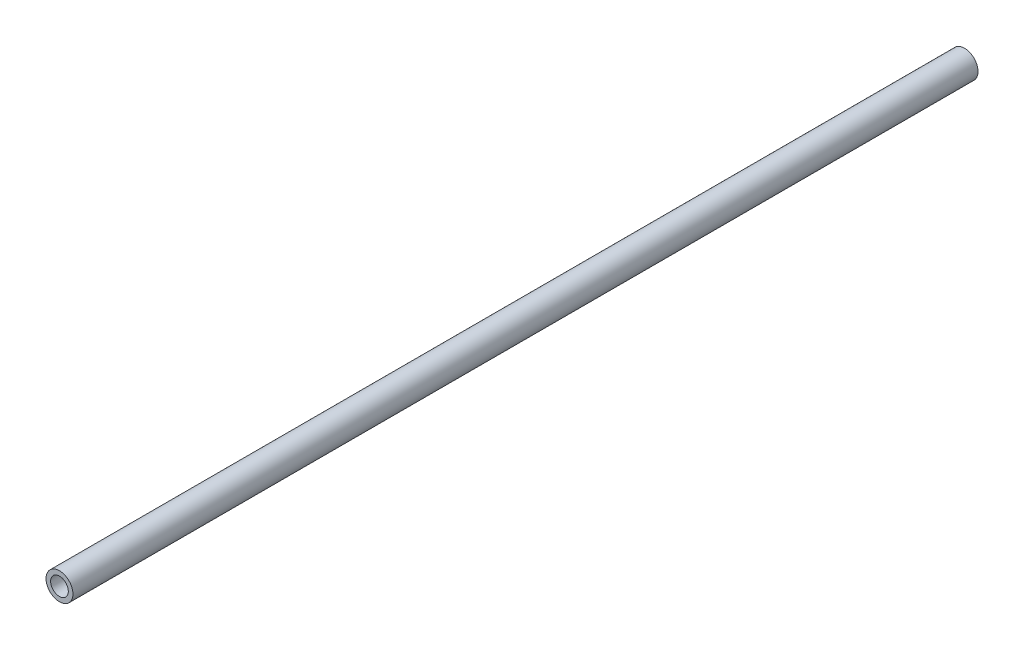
ISO-10303-21;
HEADER;
FILE_DESCRIPTION(('STEP AP214'),'2;1');
FILE_NAME('part.step','',(''),(''),'','','');
FILE_SCHEMA(('AUTOMOTIVE_DESIGN { 1 0 10303 214 1 1 1 1 }'));
ENDSEC;
DATA;
#1=APPLICATION_CONTEXT('core data for automotive mechanical design processes');
#2=APPLICATION_PROTOCOL_DEFINITION('international standard','automotive_design',2000,#1);
#3=PRODUCT_CONTEXT('',#1,'mechanical');
#4=PRODUCT('Part','Part','',(#3));
#5=PRODUCT_RELATED_PRODUCT_CATEGORY('part','',(#4));
#6=PRODUCT_DEFINITION_FORMATION('','',#4);
#7=PRODUCT_DEFINITION_CONTEXT('part definition',#1,'design');
#8=PRODUCT_DEFINITION('design','',#6,#7);
#9=PRODUCT_DEFINITION_SHAPE('','',#8);
#10=(LENGTH_UNIT() NAMED_UNIT(*) SI_UNIT(.MILLI.,.METRE.));
#11=(NAMED_UNIT(*) PLANE_ANGLE_UNIT() SI_UNIT($,.RADIAN.));
#12=(NAMED_UNIT(*) SI_UNIT($,.STERADIAN.) SOLID_ANGLE_UNIT());
#13=UNCERTAINTY_MEASURE_WITH_UNIT(LENGTH_MEASURE(1.E-05),#10,'distance_accuracy_value','');
#14=(GEOMETRIC_REPRESENTATION_CONTEXT(3) GLOBAL_UNCERTAINTY_ASSIGNED_CONTEXT((#13)) GLOBAL_UNIT_ASSIGNED_CONTEXT((#10,
#11,#12)) REPRESENTATION_CONTEXT('',''));
#15=CARTESIAN_POINT('',(0.,0.,0.));
#16=DIRECTION('',(0.,0.,1.));
#17=DIRECTION('',(1.,0.,0.));
#18=AXIS2_PLACEMENT_3D('',#15,#16,#17);
#19=CARTESIAN_POINT('',(0.,0.,205.));
#20=DIRECTION('',(0.,0.,1.));
#21=DIRECTION('',(1.,0.,0.));
#22=AXIS2_PLACEMENT_3D('',#19,#20,#21);
#23=PLANE('',#22);
#24=CARTESIAN_POINT('',(0.,0.,205.));
#25=DIRECTION('',(0.,0.,1.));
#26=DIRECTION('',(1.,0.,0.));
#27=AXIS2_PLACEMENT_3D('',#24,#25,#26);
#28=CIRCLE('',#27,3.05);
#29=CARTESIAN_POINT('',(-3.05,0.,205.));
#30=VERTEX_POINT('',#29);
#31=EDGE_CURVE('E10',#30,#30,#28,.T.);
#32=ORIENTED_EDGE('',*,*,#31,.T.);
#33=EDGE_LOOP('',(#32));
#34=FACE_BOUND('',#33,.T.);
#35=CARTESIAN_POINT('',(0.,0.,205.));
#36=DIRECTION('',(0.,0.,1.));
#37=DIRECTION('',(1.,0.,0.));
#38=AXIS2_PLACEMENT_3D('',#35,#36,#37);
#39=CIRCLE('',#38,2.);
#40=CARTESIAN_POINT('',(-2.,0.,205.));
#41=VERTEX_POINT('',#40);
#42=EDGE_CURVE('E56',#41,#41,#39,.T.);
#43=ORIENTED_EDGE('',*,*,#42,.F.);
#44=EDGE_LOOP('',(#43));
#45=FACE_BOUND('',#44,.T.);
#46=ADVANCED_FACE('F43',(#34,#45),#23,.T.);
#47=CARTESIAN_POINT('',(0.,0.,0.));
#48=DIRECTION('',(0.,0.,1.));
#49=DIRECTION('',(1.,0.,0.));
#50=AXIS2_PLACEMENT_3D('',#47,#48,#49);
#51=PLANE('',#50);
#52=CARTESIAN_POINT('',(0.,0.,0.));
#53=DIRECTION('',(0.,0.,1.));
#54=DIRECTION('',(1.,0.,0.));
#55=AXIS2_PLACEMENT_3D('',#52,#53,#54);
#56=CIRCLE('',#55,3.05);
#57=CARTESIAN_POINT('',(-3.05,0.,0.));
#58=VERTEX_POINT('',#57);
#59=EDGE_CURVE('E47',#58,#58,#56,.T.);
#60=ORIENTED_EDGE('',*,*,#59,.F.);
#61=EDGE_LOOP('',(#60));
#62=FACE_BOUND('',#61,.T.);
#63=CARTESIAN_POINT('',(0.,0.,0.));
#64=DIRECTION('',(0.,0.,1.));
#65=DIRECTION('',(1.,0.,0.));
#66=AXIS2_PLACEMENT_3D('',#63,#64,#65);
#67=CIRCLE('',#66,2.);
#68=CARTESIAN_POINT('',(-2.,0.,0.));
#69=VERTEX_POINT('',#68);
#70=EDGE_CURVE('E58',#69,#69,#67,.T.);
#71=ORIENTED_EDGE('',*,*,#70,.T.);
#72=EDGE_LOOP('',(#71));
#73=FACE_BOUND('',#72,.T.);
#74=ADVANCED_FACE('F70',(#62,#73),#51,.F.);
#75=CARTESIAN_POINT('',(0.,0.,205.));
#76=DIRECTION('',(0.,0.,-1.));
#77=DIRECTION('',(-1.,0.,0.));
#78=AXIS2_PLACEMENT_3D('',#75,#76,#77);
#79=CYLINDRICAL_SURFACE('',#78,3.05);
#80=CARTESIAN_POINT('',(-3.05,0.,205.));
#81=CARTESIAN_POINT('',(-3.05,0.,202.864583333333));
#82=CARTESIAN_POINT('',(-3.05,0.,200.729166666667));
#83=CARTESIAN_POINT('',(-3.05,0.,196.458333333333));
#84=CARTESIAN_POINT('',(-3.05,0.,194.322916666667));
#85=CARTESIAN_POINT('',(-3.05,0.,190.052083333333));
#86=CARTESIAN_POINT('',(-3.05,0.,187.916666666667));
#87=CARTESIAN_POINT('',(-3.05,0.,183.645833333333));
#88=CARTESIAN_POINT('',(-3.05,0.,181.510416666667));
#89=CARTESIAN_POINT('',(-3.05,0.,177.239583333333));
#90=CARTESIAN_POINT('',(-3.05,0.,175.104166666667));
#91=CARTESIAN_POINT('',(-3.05,0.,170.833333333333));
#92=CARTESIAN_POINT('',(-3.05,0.,168.697916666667));
#93=CARTESIAN_POINT('',(-3.05,0.,164.427083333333));
#94=CARTESIAN_POINT('',(-3.05,0.,162.291666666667));
#95=CARTESIAN_POINT('',(-3.05,0.,158.020833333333));
#96=CARTESIAN_POINT('',(-3.05,0.,155.885416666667));
#97=CARTESIAN_POINT('',(-3.05,0.,151.614583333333));
#98=CARTESIAN_POINT('',(-3.05,0.,149.479166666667));
#99=CARTESIAN_POINT('',(-3.05,0.,145.208333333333));
#100=CARTESIAN_POINT('',(-3.05,0.,143.072916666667));
#101=CARTESIAN_POINT('',(-3.05,0.,138.802083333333));
#102=CARTESIAN_POINT('',(-3.05,0.,136.666666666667));
#103=CARTESIAN_POINT('',(-3.05,0.,132.395833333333));
#104=CARTESIAN_POINT('',(-3.05,0.,130.260416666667));
#105=CARTESIAN_POINT('',(-3.05,0.,125.989583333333));
#106=CARTESIAN_POINT('',(-3.05,0.,123.854166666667));
#107=CARTESIAN_POINT('',(-3.05,0.,119.583333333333));
#108=CARTESIAN_POINT('',(-3.05,0.,117.447916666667));
#109=CARTESIAN_POINT('',(-3.05,0.,113.177083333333));
#110=CARTESIAN_POINT('',(-3.05,0.,111.041666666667));
#111=CARTESIAN_POINT('',(-3.05,0.,106.770833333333));
#112=CARTESIAN_POINT('',(-3.05,0.,104.635416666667));
#113=CARTESIAN_POINT('',(-3.05,0.,100.364583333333));
#114=CARTESIAN_POINT('',(-3.05,0.,98.2291666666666));
#115=CARTESIAN_POINT('',(-3.05,0.,93.9583333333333));
#116=CARTESIAN_POINT('',(-3.05,0.,91.8229166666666));
#117=CARTESIAN_POINT('',(-3.05,0.,87.5520833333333));
#118=CARTESIAN_POINT('',(-3.05,0.,85.4166666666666));
#119=CARTESIAN_POINT('',(-3.05,0.,81.1458333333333));
#120=CARTESIAN_POINT('',(-3.05,0.,79.0104166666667));
#121=CARTESIAN_POINT('',(-3.05,0.,74.7395833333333));
#122=CARTESIAN_POINT('',(-3.05,0.,72.6041666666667));
#123=CARTESIAN_POINT('',(-3.05,0.,68.3333333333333));
#124=CARTESIAN_POINT('',(-3.05,0.,66.1979166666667));
#125=CARTESIAN_POINT('',(-3.05,0.,61.9270833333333));
#126=CARTESIAN_POINT('',(-3.05,0.,59.7916666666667));
#127=CARTESIAN_POINT('',(-3.05,0.,55.5208333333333));
#128=CARTESIAN_POINT('',(-3.05,0.,53.3854166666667));
#129=CARTESIAN_POINT('',(-3.05,0.,49.1145833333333));
#130=CARTESIAN_POINT('',(-3.05,0.,46.9791666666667));
#131=CARTESIAN_POINT('',(-3.05,0.,42.7083333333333));
#132=CARTESIAN_POINT('',(-3.05,0.,40.5729166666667));
#133=CARTESIAN_POINT('',(-3.05,0.,36.3020833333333));
#134=CARTESIAN_POINT('',(-3.05,0.,34.1666666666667));
#135=CARTESIAN_POINT('',(-3.05,0.,29.8958333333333));
#136=CARTESIAN_POINT('',(-3.05,0.,27.7604166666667));
#137=CARTESIAN_POINT('',(-3.05,0.,23.4895833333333));
#138=CARTESIAN_POINT('',(-3.05,0.,21.3541666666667));
#139=CARTESIAN_POINT('',(-3.05,0.,17.0833333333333));
#140=CARTESIAN_POINT('',(-3.05,0.,14.9479166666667));
#141=CARTESIAN_POINT('',(-3.05,0.,10.6770833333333));
#142=CARTESIAN_POINT('',(-3.05,0.,8.54166666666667));
#143=CARTESIAN_POINT('',(-3.05,0.,4.27083333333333));
#144=CARTESIAN_POINT('',(-3.05,0.,2.13541666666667));
#145=CARTESIAN_POINT('',(-3.05,0.,0.));
#146=B_SPLINE_CURVE_WITH_KNOTS('',3,(#80,#81,#82,#83,#84,#85,#86,#87,#88,#89,#90,#91,#92,#93,
#94,#95,#96,#97,#98,#99,#100,#101,#102,#103,#104,#105,#106,#107,#108,#109,#110,#111,#112,#113,
#114,#115,#116,#117,#118,#119,#120,#121,#122,#123,#124,#125,#126,#127,#128,#129,#130,#131,#132,
#133,#134,#135,#136,#137,#138,#139,#140,#141,#142,#143,#144,#145),.UNSPECIFIED.,.F.,.F.,(4,2,2,
2,2,2,2,2,2,2,2,2,2,2,2,2,2,2,2,2,2,2,2,2,2,2,2,2,2,2,2,2,4),(0.,6.40625,12.8125,19.21875,
25.625,32.03125,38.4375,44.84375,51.25,57.65625,64.0625,70.46875,76.875,83.28125,89.6875,
96.09375,102.5,108.90625,115.3125,121.71875,128.125,134.53125,140.9375,147.34375,153.75,
160.15625,166.5625,172.96875,179.375,185.78125,192.1875,198.59375,205.),.UNSPECIFIED.);
#147=EDGE_CURVE('BSEAM45',#30,#58,#146,.T.);
#148=ORIENTED_EDGE('',*,*,#31,.F.);
#149=ORIENTED_EDGE('',*,*,#59,.T.);
#150=ORIENTED_EDGE('',*,*,#147,.T.);
#151=ORIENTED_EDGE('',*,*,#147,.F.);
#152=EDGE_LOOP('',(#148,#150,#149,#151));
#153=FACE_BOUND('',#152,.T.);
#154=ADVANCED_FACE('F45',(#153),#79,.T.);
#155=CARTESIAN_POINT('',(0.,0.,205.));
#156=DIRECTION('',(0.,0.,-1.));
#157=DIRECTION('',(-1.,0.,0.));
#158=AXIS2_PLACEMENT_3D('',#155,#156,#157);
#159=CYLINDRICAL_SURFACE('',#158,2.);
#160=CARTESIAN_POINT('',(-2.,0.,205.));
#161=CARTESIAN_POINT('',(-2.,0.,202.864583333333));
#162=CARTESIAN_POINT('',(-2.,0.,200.729166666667));
#163=CARTESIAN_POINT('',(-2.,0.,196.458333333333));
#164=CARTESIAN_POINT('',(-2.,0.,194.322916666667));
#165=CARTESIAN_POINT('',(-2.,0.,190.052083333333));
#166=CARTESIAN_POINT('',(-2.,0.,187.916666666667));
#167=CARTESIAN_POINT('',(-2.,0.,183.645833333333));
#168=CARTESIAN_POINT('',(-2.,0.,181.510416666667));
#169=CARTESIAN_POINT('',(-2.,0.,177.239583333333));
#170=CARTESIAN_POINT('',(-2.,0.,175.104166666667));
#171=CARTESIAN_POINT('',(-2.,0.,170.833333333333));
#172=CARTESIAN_POINT('',(-2.,0.,168.697916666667));
#173=CARTESIAN_POINT('',(-2.,0.,164.427083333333));
#174=CARTESIAN_POINT('',(-2.,0.,162.291666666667));
#175=CARTESIAN_POINT('',(-2.,0.,158.020833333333));
#176=CARTESIAN_POINT('',(-2.,0.,155.885416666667));
#177=CARTESIAN_POINT('',(-2.,0.,151.614583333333));
#178=CARTESIAN_POINT('',(-2.,0.,149.479166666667));
#179=CARTESIAN_POINT('',(-2.,0.,145.208333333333));
#180=CARTESIAN_POINT('',(-2.,0.,143.072916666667));
#181=CARTESIAN_POINT('',(-2.,0.,138.802083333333));
#182=CARTESIAN_POINT('',(-2.,0.,136.666666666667));
#183=CARTESIAN_POINT('',(-2.,0.,132.395833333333));
#184=CARTESIAN_POINT('',(-2.,0.,130.260416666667));
#185=CARTESIAN_POINT('',(-2.,0.,125.989583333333));
#186=CARTESIAN_POINT('',(-2.,0.,123.854166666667));
#187=CARTESIAN_POINT('',(-2.,0.,119.583333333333));
#188=CARTESIAN_POINT('',(-2.,0.,117.447916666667));
#189=CARTESIAN_POINT('',(-2.,0.,113.177083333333));
#190=CARTESIAN_POINT('',(-2.,0.,111.041666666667));
#191=CARTESIAN_POINT('',(-2.,0.,106.770833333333));
#192=CARTESIAN_POINT('',(-2.,0.,104.635416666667));
#193=CARTESIAN_POINT('',(-2.,0.,100.364583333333));
#194=CARTESIAN_POINT('',(-2.,0.,98.2291666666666));
#195=CARTESIAN_POINT('',(-2.,0.,93.9583333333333));
#196=CARTESIAN_POINT('',(-2.,0.,91.8229166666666));
#197=CARTESIAN_POINT('',(-2.,0.,87.5520833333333));
#198=CARTESIAN_POINT('',(-2.,0.,85.4166666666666));
#199=CARTESIAN_POINT('',(-2.,0.,81.1458333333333));
#200=CARTESIAN_POINT('',(-2.,0.,79.0104166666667));
#201=CARTESIAN_POINT('',(-2.,0.,74.7395833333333));
#202=CARTESIAN_POINT('',(-2.,0.,72.6041666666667));
#203=CARTESIAN_POINT('',(-2.,0.,68.3333333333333));
#204=CARTESIAN_POINT('',(-2.,0.,66.1979166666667));
#205=CARTESIAN_POINT('',(-2.,0.,61.9270833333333));
#206=CARTESIAN_POINT('',(-2.,0.,59.7916666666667));
#207=CARTESIAN_POINT('',(-2.,0.,55.5208333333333));
#208=CARTESIAN_POINT('',(-2.,0.,53.3854166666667));
#209=CARTESIAN_POINT('',(-2.,0.,49.1145833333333));
#210=CARTESIAN_POINT('',(-2.,0.,46.9791666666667));
#211=CARTESIAN_POINT('',(-2.,0.,42.7083333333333));
#212=CARTESIAN_POINT('',(-2.,0.,40.5729166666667));
#213=CARTESIAN_POINT('',(-2.,0.,36.3020833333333));
#214=CARTESIAN_POINT('',(-2.,0.,34.1666666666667));
#215=CARTESIAN_POINT('',(-2.,0.,29.8958333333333));
#216=CARTESIAN_POINT('',(-2.,0.,27.7604166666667));
#217=CARTESIAN_POINT('',(-2.,0.,23.4895833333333));
#218=CARTESIAN_POINT('',(-2.,0.,21.3541666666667));
#219=CARTESIAN_POINT('',(-2.,0.,17.0833333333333));
#220=CARTESIAN_POINT('',(-2.,0.,14.9479166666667));
#221=CARTESIAN_POINT('',(-2.,0.,10.6770833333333));
#222=CARTESIAN_POINT('',(-2.,0.,8.54166666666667));
#223=CARTESIAN_POINT('',(-2.,0.,4.27083333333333));
#224=CARTESIAN_POINT('',(-2.,0.,2.13541666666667));
#225=CARTESIAN_POINT('',(-2.,0.,0.));
#226=B_SPLINE_CURVE_WITH_KNOTS('',3,(#160,#161,#162,#163,#164,#165,#166,#167,#168,#169,#170,
#171,#172,#173,#174,#175,#176,#177,#178,#179,#180,#181,#182,#183,#184,#185,#186,#187,#188,#189,
#190,#191,#192,#193,#194,#195,#196,#197,#198,#199,#200,#201,#202,#203,#204,#205,#206,#207,#208,
#209,#210,#211,#212,#213,#214,#215,#216,#217,#218,#219,#220,#221,#222,#223,#224,#225),
.UNSPECIFIED.,.F.,.F.,(4,2,2,2,2,2,2,2,2,2,2,2,2,2,2,2,2,2,2,2,2,2,2,2,2,2,2,2,2,2,2,2,4),(0.,
6.40625,12.8125,19.21875,25.625,32.03125,38.4375,44.84375,51.25,57.65625,64.0625,70.46875,
76.875,83.28125,89.6875,96.09375,102.5,108.90625,115.3125,121.71875,128.125,134.53125,140.9375,
147.34375,153.75,160.15625,166.5625,172.96875,179.375,185.78125,192.1875,198.59375,205.),.UNSPECIFIED.);
#227=EDGE_CURVE('BSEAM66',#41,#69,#226,.T.);
#228=ORIENTED_EDGE('',*,*,#42,.T.);
#229=ORIENTED_EDGE('',*,*,#70,.F.);
#230=ORIENTED_EDGE('',*,*,#227,.T.);
#231=ORIENTED_EDGE('',*,*,#227,.F.);
#232=EDGE_LOOP('',(#228,#230,#229,#231));
#233=FACE_BOUND('',#232,.T.);
#234=ADVANCED_FACE('F66',(#233),#159,.F.);
#235=CLOSED_SHELL('',(#46,#74,#154,#234));
#236=MANIFOLD_SOLID_BREP('B2',#235);
#237=ADVANCED_BREP_SHAPE_REPRESENTATION('',(#18,#236),#14);
#238=SHAPE_DEFINITION_REPRESENTATION(#9,#237);
ENDSEC;
END-ISO-10303-21;
